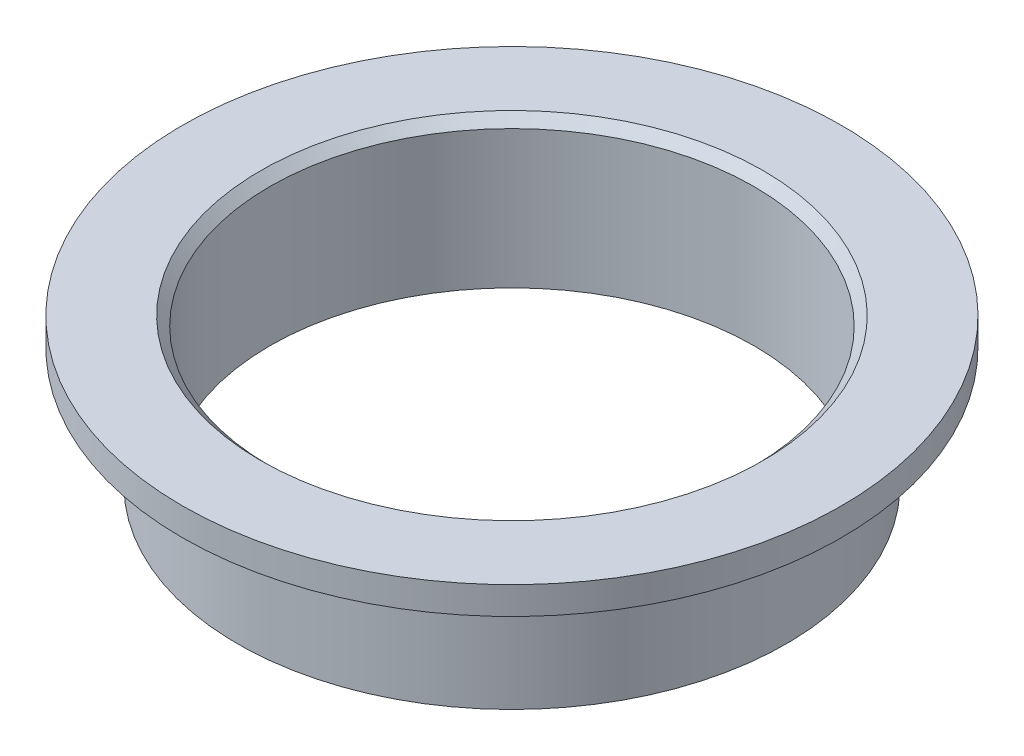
from build123d import *

# Parameters (mm, degrees)
SKETCH1_R           = 7.46
SKETCH1_R_2         = 6.58
BOSS_EXTRUDE1_DEPTH = 3.25
SKETCH2_R           = 8.96
SKETCH2_R_2         = 6.58
BOSS_EXTRUDE2_DEPTH = 0.75
CHAMFER1_SIZE       = 0.25


with BuildPart() as part:
    # Sketch1 → Boss-Extrude1 (new body)
    with BuildSketch(Plane(origin=(0, 0, 0), x_dir=(1, 0, 0), z_dir=(0, 1, 0))):
        with Locations(Location((0, 0, 0), (0, 0, 90))):
            Circle(SKETCH1_R)
        with Locations(Location((0, 0, 0), (0, 0, 90))):
            Circle(SKETCH1_R_2, mode=Mode.SUBTRACT)
    extrude(amount=BOSS_EXTRUDE1_DEPTH)

    # Sketch2 → Boss-Extrude2 (add)
    with BuildSketch(Plane(origin=(0, 3.25, 0), x_dir=(1, 0, 0), z_dir=(0, 1, 0))):
        with Locations(Location((0, 0, 0), (0, 0, 270))):
            Circle(SKETCH2_R)
        with Locations(Location((0, 0, 0), (0, 0, 90))):
            Circle(SKETCH2_R_2, mode=Mode.SUBTRACT)
    extrude(amount=BOSS_EXTRUDE2_DEPTH)

    # Chamfer1
    chamfer1_edges = [part.edges().sort_by_distance(p)[0] for p in [
        (0, 4, 6.58),
    ]]
    chamfer(chamfer1_edges, length=CHAMFER1_SIZE)


solid = part.part
